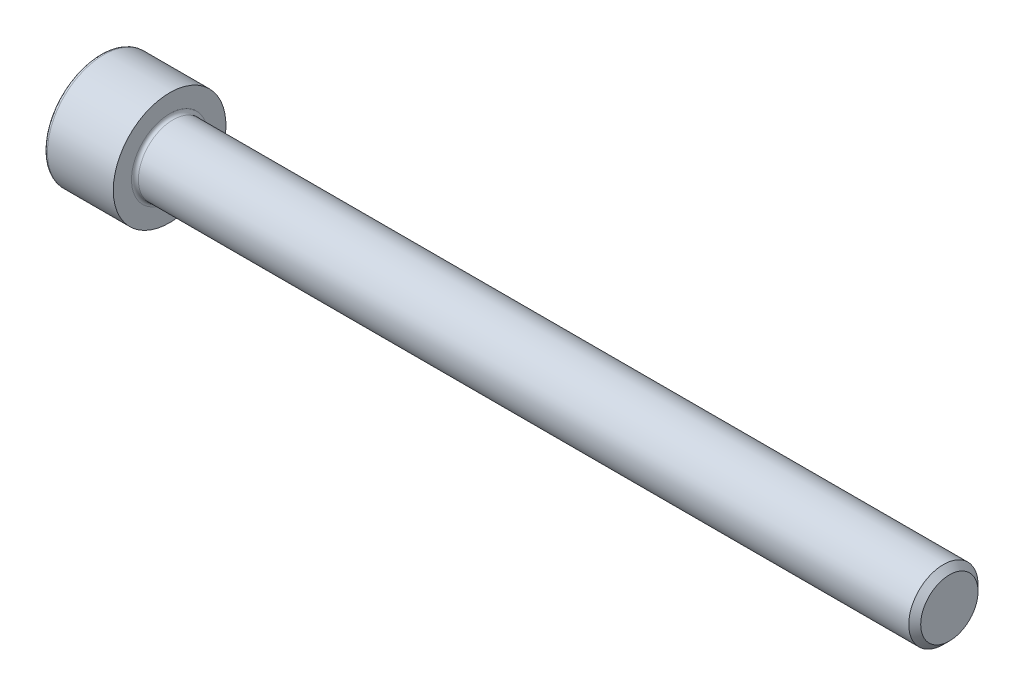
from build123d import *

# Parameters (mm, degrees)
FILLET1_R   = 0.4
FILLET2_R   = 0.4
HEX_2_DEPTH = 4


with BuildPart() as part:
    # BodySke → Base-Revolve (revolve)
    with BuildSketch(Plane.XY, mode=Mode.PRIVATE) as base_revolve_sk:
        Polygon((0, 0), (0, 6.5), (8, 6.5), (8, 4), (97.3095, 4), (98, 3.3095), (98, 0), align=None)
    revolve(base_revolve_sk.sketch.rotate(Axis((-31.75, 0, 0), (1, 0, 0)), 90), axis=Axis((-31.75, 0, 0), (1, 0, 0)))

    # Fillet1
    fillet1_edges = [part.edges().sort_by_distance(p)[0] for p in [
        (8, 0, -4),
    ]]
    fillet(fillet1_edges, radius=FILLET1_R)

    # Fillet2
    fillet2_edges = [part.edges().sort_by_distance(p)[0] for p in [
        (0, 0, -6.5),
    ]]
    fillet(fillet2_edges, radius=FILLET2_R)

    # Sketch2 → Hex-PreBroach (revolve, cut)
    with BuildSketch(Plane.XY, mode=Mode.PRIVATE) as hex_prebroach_sk:
        Polygon((0, 3.0475), (4, 3.0475), (5.759474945, 0), (0, 0), align=None)
    revolve(hex_prebroach_sk.sketch.rotate(Axis((0, 0, 0), (1, 0, 0)), 90), axis=Axis((0, 0, 0), (1, 0, 0)), mode=Mode.SUBTRACT)

    # Sketch3 → Hex 2 (cut)
    with BuildSketch(Plane(origin=(0, 0, 0), x_dir=(0, 0.500000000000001, 0.866025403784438), z_dir=(-1, 0, 0))):
        Polygon((1.759474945, 3.0475), (-1.759474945, 3.0475), (-3.518949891, 0), (-1.759474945, -3.0475), (1.759474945, -3.0475), (3.518949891, 0), align=None)
    extrude(amount=-HEX_2_DEPTH, mode=Mode.SUBTRACT)


solid = part.part
